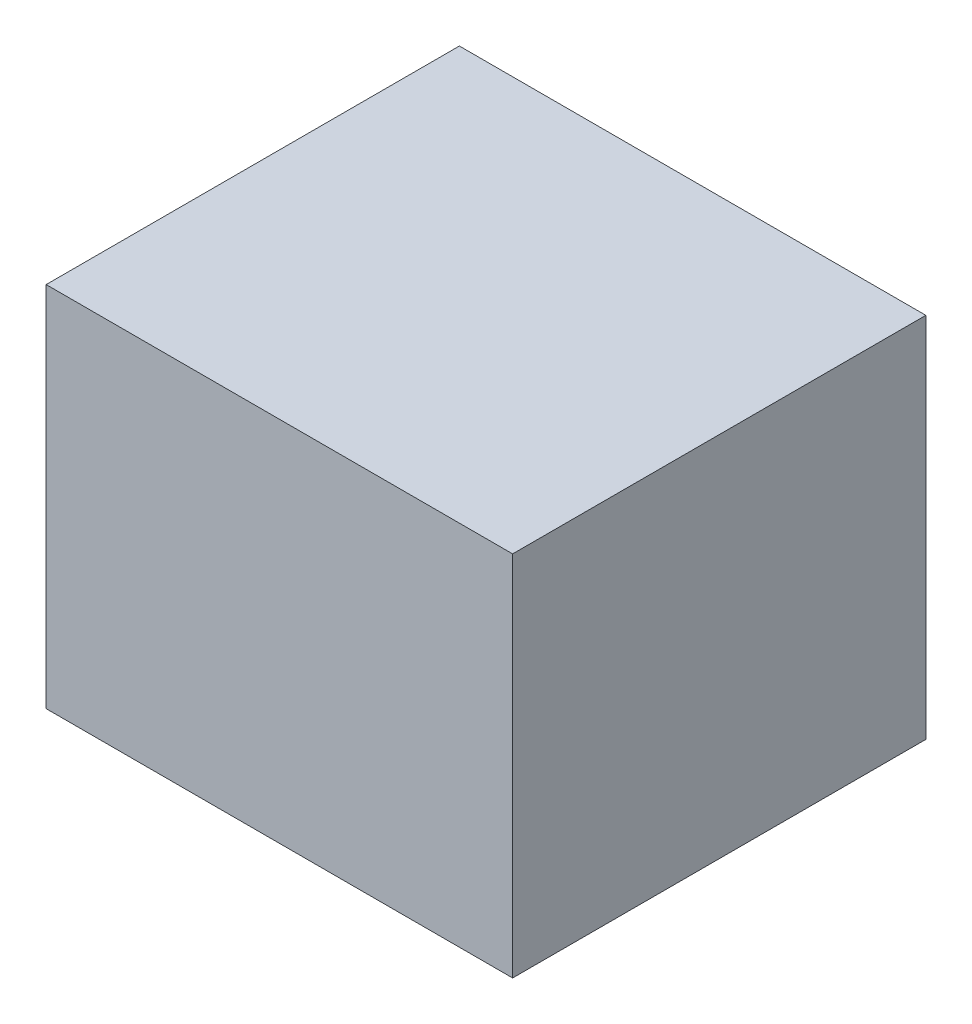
ISO-10303-21;
HEADER;
FILE_DESCRIPTION(('STEP AP214'),'2;1');
FILE_NAME('part.step','',(''),(''),'','','');
FILE_SCHEMA(('AUTOMOTIVE_DESIGN { 1 0 10303 214 1 1 1 1 }'));
ENDSEC;
DATA;
#1=APPLICATION_CONTEXT('core data for automotive mechanical design processes');
#2=APPLICATION_PROTOCOL_DEFINITION('international standard','automotive_design',2000,#1);
#3=PRODUCT_CONTEXT('',#1,'mechanical');
#4=PRODUCT('Part','Part','',(#3));
#5=PRODUCT_RELATED_PRODUCT_CATEGORY('part','',(#4));
#6=PRODUCT_DEFINITION_FORMATION('','',#4);
#7=PRODUCT_DEFINITION_CONTEXT('part definition',#1,'design');
#8=PRODUCT_DEFINITION('design','',#6,#7);
#9=PRODUCT_DEFINITION_SHAPE('','',#8);
#10=(LENGTH_UNIT() NAMED_UNIT(*) SI_UNIT(.MILLI.,.METRE.));
#11=(NAMED_UNIT(*) PLANE_ANGLE_UNIT() SI_UNIT($,.RADIAN.));
#12=(NAMED_UNIT(*) SI_UNIT($,.STERADIAN.) SOLID_ANGLE_UNIT());
#13=UNCERTAINTY_MEASURE_WITH_UNIT(LENGTH_MEASURE(1.E-05),#10,'distance_accuracy_value','');
#14=(GEOMETRIC_REPRESENTATION_CONTEXT(3) GLOBAL_UNCERTAINTY_ASSIGNED_CONTEXT((#13)) GLOBAL_UNIT_ASSIGNED_CONTEXT((#10,
#11,#12)) REPRESENTATION_CONTEXT('',''));
#15=CARTESIAN_POINT('',(0.,0.,0.));
#16=DIRECTION('',(0.,0.,1.));
#17=DIRECTION('',(1.,0.,0.));
#18=AXIS2_PLACEMENT_3D('',#15,#16,#17);
#19=CARTESIAN_POINT('',(0.,0.,1.79999894));
#20=DIRECTION('',(0.,0.,-1.));
#21=DIRECTION('',(0.,-1.,0.));
#22=AXIS2_PLACEMENT_3D('',#19,#20,#21);
#23=PLANE('',#22);
#24=DIRECTION('',(1.,0.,0.));
#25=VECTOR('',#24,1.);
#26=CARTESIAN_POINT('',(-1.016,0.80000094,1.79999894));
#27=LINE('',#26,#25);
#28=CARTESIAN_POINT('',(-1.016,0.80000094,1.79999894));
#29=VERTEX_POINT('',#28);
#30=CARTESIAN_POINT('',(1.016,0.80000094,1.79999894));
#31=VERTEX_POINT('',#30);
#32=EDGE_CURVE('E27',#29,#31,#27,.T.);
#33=ORIENTED_EDGE('',*,*,#32,.F.);
#34=DIRECTION('',(0.,1.,0.));
#35=VECTOR('',#34,1.);
#36=CARTESIAN_POINT('',(-1.016,-0.80000094,1.79999894));
#37=LINE('',#36,#35);
#38=CARTESIAN_POINT('',(-1.016,-0.80000094,1.79999894));
#39=VERTEX_POINT('',#38);
#40=EDGE_CURVE('E65',#39,#29,#37,.T.);
#41=ORIENTED_EDGE('',*,*,#40,.F.);
#42=DIRECTION('',(-1.,0.,0.));
#43=VECTOR('',#42,1.);
#44=CARTESIAN_POINT('',(1.016,-0.80000094,1.79999894));
#45=LINE('',#44,#43);
#46=CARTESIAN_POINT('',(1.016,-0.80000094,1.79999894));
#47=VERTEX_POINT('',#46);
#48=EDGE_CURVE('E69',#47,#39,#45,.T.);
#49=ORIENTED_EDGE('',*,*,#48,.F.);
#50=DIRECTION('',(0.,-1.,0.));
#51=VECTOR('',#50,1.);
#52=CARTESIAN_POINT('',(1.016,0.80000094,1.79999894));
#53=LINE('',#52,#51);
#54=EDGE_CURVE('E107',#31,#47,#53,.T.);
#55=ORIENTED_EDGE('',*,*,#54,.F.);
#56=EDGE_LOOP('',(#33,#41,#49,#55));
#57=FACE_BOUND('',#56,.T.);
#58=ADVANCED_FACE('F17',(#57),#23,.F.);
#59=CARTESIAN_POINT('',(0.,0.,0.));
#60=DIRECTION('',(0.,0.,-1.));
#61=DIRECTION('',(0.,-1.,0.));
#62=AXIS2_PLACEMENT_3D('',#59,#60,#61);
#63=PLANE('',#62);
#64=DIRECTION('',(0.,-1.,0.));
#65=VECTOR('',#64,1.);
#66=CARTESIAN_POINT('',(1.016,0.80000094,0.));
#67=LINE('',#66,#65);
#68=CARTESIAN_POINT('',(1.016,0.80000094,0.));
#69=VERTEX_POINT('',#68);
#70=CARTESIAN_POINT('',(1.016,-0.80000094,0.));
#71=VERTEX_POINT('',#70);
#72=EDGE_CURVE('E90',#69,#71,#67,.T.);
#73=ORIENTED_EDGE('',*,*,#72,.T.);
#74=DIRECTION('',(-1.,0.,0.));
#75=VECTOR('',#74,1.);
#76=CARTESIAN_POINT('',(1.016,-0.80000094,0.));
#77=LINE('',#76,#75);
#78=CARTESIAN_POINT('',(-1.016,-0.80000094,0.));
#79=VERTEX_POINT('',#78);
#80=EDGE_CURVE('E75',#71,#79,#77,.T.);
#81=ORIENTED_EDGE('',*,*,#80,.T.);
#82=DIRECTION('',(0.,1.,0.));
#83=VECTOR('',#82,1.);
#84=CARTESIAN_POINT('',(-1.016,-0.80000094,0.));
#85=LINE('',#84,#83);
#86=CARTESIAN_POINT('',(-1.016,0.80000094,0.));
#87=VERTEX_POINT('',#86);
#88=EDGE_CURVE('E80',#79,#87,#85,.T.);
#89=ORIENTED_EDGE('',*,*,#88,.T.);
#90=DIRECTION('',(1.,0.,0.));
#91=VECTOR('',#90,1.);
#92=CARTESIAN_POINT('',(-1.016,0.80000094,0.));
#93=LINE('',#92,#91);
#94=EDGE_CURVE('E11',#87,#69,#93,.T.);
#95=ORIENTED_EDGE('',*,*,#94,.T.);
#96=EDGE_LOOP('',(#73,#81,#89,#95));
#97=FACE_BOUND('',#96,.T.);
#98=ADVANCED_FACE('F19',(#97),#63,.T.);
#99=CARTESIAN_POINT('',(-1.016,0.80000094,0.));
#100=DIRECTION('',(0.,1.,0.));
#101=DIRECTION('',(1.,0.,0.));
#102=AXIS2_PLACEMENT_3D('',#99,#100,#101);
#103=PLANE('',#102);
#104=DIRECTION('',(0.,0.,1.));
#105=VECTOR('',#104,1.);
#106=CARTESIAN_POINT('',(-1.016,0.80000094,0.));
#107=LINE('',#106,#105);
#108=EDGE_CURVE('E74',#87,#29,#107,.T.);
#109=ORIENTED_EDGE('',*,*,#108,.T.);
#110=ORIENTED_EDGE('',*,*,#32,.T.);
#111=DIRECTION('',(0.,0.,1.));
#112=VECTOR('',#111,1.);
#113=CARTESIAN_POINT('',(1.016,0.80000094,0.));
#114=LINE('',#113,#112);
#115=EDGE_CURVE('E106',#69,#31,#114,.T.);
#116=ORIENTED_EDGE('',*,*,#115,.F.);
#117=ORIENTED_EDGE('',*,*,#94,.F.);
#118=EDGE_LOOP('',(#109,#110,#116,#117));
#119=FACE_BOUND('',#118,.T.);
#120=ADVANCED_FACE('F104',(#119),#103,.T.);
#121=CARTESIAN_POINT('',(-1.016,-0.80000094,0.));
#122=DIRECTION('',(-1.,0.,0.));
#123=DIRECTION('',(0.,0.,1.));
#124=AXIS2_PLACEMENT_3D('',#121,#122,#123);
#125=PLANE('',#124);
#126=DIRECTION('',(0.,0.,1.));
#127=VECTOR('',#126,1.);
#128=CARTESIAN_POINT('',(-1.016,-0.80000094,0.));
#129=LINE('',#128,#127);
#130=EDGE_CURVE('E78',#79,#39,#129,.T.);
#131=ORIENTED_EDGE('',*,*,#130,.T.);
#132=ORIENTED_EDGE('',*,*,#40,.T.);
#133=ORIENTED_EDGE('',*,*,#108,.F.);
#134=ORIENTED_EDGE('',*,*,#88,.F.);
#135=EDGE_LOOP('',(#131,#132,#133,#134));
#136=FACE_BOUND('',#135,.T.);
#137=ADVANCED_FACE('F79',(#136),#125,.T.);
#138=CARTESIAN_POINT('',(1.016,-0.80000094,0.));
#139=DIRECTION('',(0.,-1.,0.));
#140=DIRECTION('',(0.,0.,-1.));
#141=AXIS2_PLACEMENT_3D('',#138,#139,#140);
#142=PLANE('',#141);
#143=DIRECTION('',(0.,0.,1.));
#144=VECTOR('',#143,1.);
#145=CARTESIAN_POINT('',(1.016,-0.80000094,0.));
#146=LINE('',#145,#144);
#147=EDGE_CURVE('E87',#71,#47,#146,.T.);
#148=ORIENTED_EDGE('',*,*,#147,.T.);
#149=ORIENTED_EDGE('',*,*,#48,.T.);
#150=ORIENTED_EDGE('',*,*,#130,.F.);
#151=ORIENTED_EDGE('',*,*,#80,.F.);
#152=EDGE_LOOP('',(#148,#149,#150,#151));
#153=FACE_BOUND('',#152,.T.);
#154=ADVANCED_FACE('F85',(#153),#142,.T.);
#155=CARTESIAN_POINT('',(1.016,0.80000094,0.));
#156=DIRECTION('',(1.,0.,0.));
#157=DIRECTION('',(0.,1.,0.));
#158=AXIS2_PLACEMENT_3D('',#155,#156,#157);
#159=PLANE('',#158);
#160=ORIENTED_EDGE('',*,*,#115,.T.);
#161=ORIENTED_EDGE('',*,*,#54,.T.);
#162=ORIENTED_EDGE('',*,*,#147,.F.);
#163=ORIENTED_EDGE('',*,*,#72,.F.);
#164=EDGE_LOOP('',(#160,#161,#162,#163));
#165=FACE_BOUND('',#164,.T.);
#166=ADVANCED_FACE('F112',(#165),#159,.T.);
#167=CLOSED_SHELL('',(#58,#98,#120,#137,#154,#166));
#168=MANIFOLD_SOLID_BREP('B1',#167);
#169=ADVANCED_BREP_SHAPE_REPRESENTATION('',(#18,#168),#14);
#170=SHAPE_DEFINITION_REPRESENTATION(#9,#169);
ENDSEC;
END-ISO-10303-21;
